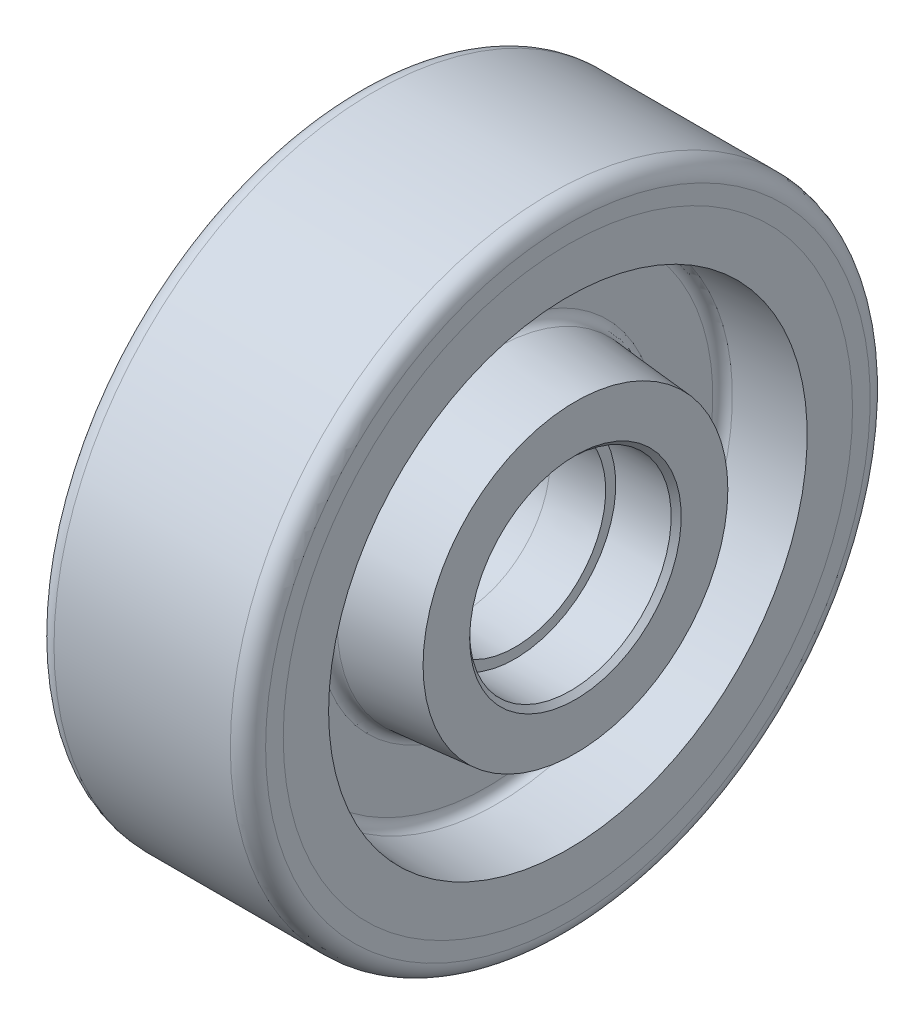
ISO-10303-21;
HEADER;
FILE_DESCRIPTION(('STEP AP214'),'2;1');
FILE_NAME('part.step','',(''),(''),'','','');
FILE_SCHEMA(('AUTOMOTIVE_DESIGN { 1 0 10303 214 1 1 1 1 }'));
ENDSEC;
DATA;
#1=APPLICATION_CONTEXT('core data for automotive mechanical design processes');
#2=APPLICATION_PROTOCOL_DEFINITION('international standard','automotive_design',2000,#1);
#3=PRODUCT_CONTEXT('',#1,'mechanical');
#4=PRODUCT('Part','Part','',(#3));
#5=PRODUCT_RELATED_PRODUCT_CATEGORY('part','',(#4));
#6=PRODUCT_DEFINITION_FORMATION('','',#4);
#7=PRODUCT_DEFINITION_CONTEXT('part definition',#1,'design');
#8=PRODUCT_DEFINITION('design','',#6,#7);
#9=PRODUCT_DEFINITION_SHAPE('','',#8);
#10=(LENGTH_UNIT() NAMED_UNIT(*) SI_UNIT(.MILLI.,.METRE.));
#11=(NAMED_UNIT(*) PLANE_ANGLE_UNIT() SI_UNIT($,.RADIAN.));
#12=(NAMED_UNIT(*) SI_UNIT($,.STERADIAN.) SOLID_ANGLE_UNIT());
#13=UNCERTAINTY_MEASURE_WITH_UNIT(LENGTH_MEASURE(1.E-05),#10,'distance_accuracy_value','');
#14=(GEOMETRIC_REPRESENTATION_CONTEXT(3) GLOBAL_UNCERTAINTY_ASSIGNED_CONTEXT((#13)) GLOBAL_UNIT_ASSIGNED_CONTEXT((#10,
#11,#12)) REPRESENTATION_CONTEXT('',''));
#15=CARTESIAN_POINT('',(0.,0.,0.));
#16=DIRECTION('',(0.,0.,1.));
#17=DIRECTION('',(1.,0.,0.));
#18=AXIS2_PLACEMENT_3D('',#15,#16,#17);
#19=CARTESIAN_POINT('',(-17.5000000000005,0.,0.));
#20=DIRECTION('',(-1.,0.,0.));
#21=DIRECTION('',(0.,0.,1.));
#22=AXIS2_PLACEMENT_3D('',#19,#20,#21);
#23=TOROIDAL_SURFACE('',#22,60.,3.5);
#24=CARTESIAN_POINT('',(-21.0000000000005,0.,0.));
#25=DIRECTION('',(-1.,0.,0.));
#26=DIRECTION('',(0.,0.,1.));
#27=AXIS2_PLACEMENT_3D('',#24,#25,#26);
#28=CIRCLE('',#27,59.9999999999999);
#29=CARTESIAN_POINT('',(-21.0000000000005,0.,59.9999999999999));
#30=VERTEX_POINT('',#29);
#31=EDGE_CURVE('E11',#30,#30,#28,.T.);
#32=ORIENTED_EDGE('',*,*,#31,.F.);
#33=EDGE_LOOP('',(#32));
#34=FACE_BOUND('',#33,.T.);
#35=CARTESIAN_POINT('',(-17.5000000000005,0.,0.));
#36=DIRECTION('',(-1.,0.,0.));
#37=DIRECTION('',(0.,0.,1.));
#38=AXIS2_PLACEMENT_3D('',#35,#36,#37);
#39=CIRCLE('',#38,63.5);
#40=CARTESIAN_POINT('',(-17.5000000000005,0.,63.5));
#41=VERTEX_POINT('',#40);
#42=EDGE_CURVE('E70',#41,#41,#39,.T.);
#43=ORIENTED_EDGE('',*,*,#42,.T.);
#44=EDGE_LOOP('',(#43));
#45=FACE_BOUND('',#44,.T.);
#46=ADVANCED_FACE('F45',(#34,#45),#23,.T.);
#47=CARTESIAN_POINT('',(-21.0000000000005,0.,-56.5));
#48=DIRECTION('',(1.,0.,0.));
#49=DIRECTION('',(0.,0.,-1.));
#50=AXIS2_PLACEMENT_3D('',#47,#48,#49);
#51=PLANE('',#50);
#52=CARTESIAN_POINT('',(-21.0000000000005,0.,0.));
#53=DIRECTION('',(-1.,0.,0.));
#54=DIRECTION('',(0.,0.,1.));
#55=AXIS2_PLACEMENT_3D('',#52,#53,#54);
#56=CIRCLE('',#55,56.5);
#57=CARTESIAN_POINT('',(-21.0000000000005,0.,56.5));
#58=VERTEX_POINT('',#57);
#59=EDGE_CURVE('E51',#58,#58,#56,.T.);
#60=ORIENTED_EDGE('',*,*,#59,.F.);
#61=EDGE_LOOP('',(#60));
#62=FACE_BOUND('',#61,.T.);
#63=ORIENTED_EDGE('',*,*,#31,.T.);
#64=EDGE_LOOP('',(#63));
#65=FACE_BOUND('',#64,.T.);
#66=ADVANCED_FACE('F101',(#62,#65),#51,.F.);
#67=CARTESIAN_POINT('',(-21.0000000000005,0.,0.));
#68=DIRECTION('',(1.,0.,0.));
#69=DIRECTION('',(0.,0.,-1.));
#70=AXIS2_PLACEMENT_3D('',#67,#68,#69);
#71=CONICAL_SURFACE('',#70,56.5,0.0523598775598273);
#72=CARTESIAN_POINT('',(-4.54497550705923E-13,0.,0.));
#73=DIRECTION('',(-1.,0.,0.));
#74=DIRECTION('',(0.,0.,1.));
#75=AXIS2_PLACEMENT_3D('',#72,#73,#74);
#76=CIRCLE('',#75,57.6005633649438);
#77=CARTESIAN_POINT('',(-4.54497550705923E-13,0.,57.6005633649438));
#78=VERTEX_POINT('',#77);
#79=EDGE_CURVE('E55',#78,#78,#76,.T.);
#80=ORIENTED_EDGE('',*,*,#79,.F.);
#81=EDGE_LOOP('',(#80));
#82=FACE_BOUND('',#81,.T.);
#83=ORIENTED_EDGE('',*,*,#59,.T.);
#84=EDGE_LOOP('',(#83));
#85=FACE_BOUND('',#84,.T.);
#86=ADVANCED_FACE('F96',(#82,#85),#71,.F.);
#87=CARTESIAN_POINT('',(-4.54497550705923E-13,0.,0.));
#88=DIRECTION('',(-1.,0.,0.));
#89=DIRECTION('',(0.,0.,1.));
#90=AXIS2_PLACEMENT_3D('',#87,#88,#89);
#91=CONICAL_SURFACE('',#90,57.6005633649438,0.0523598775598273);
#92=CARTESIAN_POINT('',(20.9999999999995,0.,0.));
#93=DIRECTION('',(-1.,0.,0.));
#94=DIRECTION('',(0.,0.,1.));
#95=AXIS2_PLACEMENT_3D('',#92,#93,#94);
#96=CIRCLE('',#95,56.5);
#97=CARTESIAN_POINT('',(20.9999999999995,0.,56.5));
#98=VERTEX_POINT('',#97);
#99=EDGE_CURVE('E59',#98,#98,#96,.T.);
#100=ORIENTED_EDGE('',*,*,#99,.F.);
#101=EDGE_LOOP('',(#100));
#102=FACE_BOUND('',#101,.T.);
#103=ORIENTED_EDGE('',*,*,#79,.T.);
#104=EDGE_LOOP('',(#103));
#105=FACE_BOUND('',#104,.T.);
#106=ADVANCED_FACE('F90',(#102,#105),#91,.F.);
#107=CARTESIAN_POINT('',(20.9999999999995,0.,-56.5));
#108=DIRECTION('',(-1.,0.,0.));
#109=DIRECTION('',(0.,0.,1.));
#110=AXIS2_PLACEMENT_3D('',#107,#108,#109);
#111=PLANE('',#110);
#112=CARTESIAN_POINT('',(20.9999999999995,0.,0.));
#113=DIRECTION('',(-1.,0.,0.));
#114=DIRECTION('',(0.,0.,1.));
#115=AXIS2_PLACEMENT_3D('',#112,#113,#114);
#116=CIRCLE('',#115,60.);
#117=CARTESIAN_POINT('',(20.9999999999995,0.,60.));
#118=VERTEX_POINT('',#117);
#119=EDGE_CURVE('E64',#118,#118,#116,.T.);
#120=ORIENTED_EDGE('',*,*,#119,.F.);
#121=EDGE_LOOP('',(#120));
#122=FACE_BOUND('',#121,.T.);
#123=ORIENTED_EDGE('',*,*,#99,.T.);
#124=EDGE_LOOP('',(#123));
#125=FACE_BOUND('',#124,.T.);
#126=ADVANCED_FACE('F84',(#122,#125),#111,.F.);
#127=CARTESIAN_POINT('',(17.4999999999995,0.,0.));
#128=DIRECTION('',(-1.,0.,0.));
#129=DIRECTION('',(0.,0.,1.));
#130=AXIS2_PLACEMENT_3D('',#127,#128,#129);
#131=TOROIDAL_SURFACE('',#130,60.,3.5);
#132=CARTESIAN_POINT('',(17.4999999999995,0.,0.));
#133=DIRECTION('',(-1.,0.,0.));
#134=DIRECTION('',(0.,0.,1.));
#135=AXIS2_PLACEMENT_3D('',#132,#133,#134);
#136=CIRCLE('',#135,63.5);
#137=CARTESIAN_POINT('',(17.4999999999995,0.,63.5));
#138=VERTEX_POINT('',#137);
#139=EDGE_CURVE('E67',#138,#138,#136,.T.);
#140=ORIENTED_EDGE('',*,*,#139,.F.);
#141=EDGE_LOOP('',(#140));
#142=FACE_BOUND('',#141,.T.);
#143=ORIENTED_EDGE('',*,*,#119,.T.);
#144=EDGE_LOOP('',(#143));
#145=FACE_BOUND('',#144,.T.);
#146=ADVANCED_FACE('F78',(#142,#145),#131,.T.);
#147=CARTESIAN_POINT('',(-24.8072464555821,0.,0.));
#148=DIRECTION('',(-1.,0.,0.));
#149=DIRECTION('',(0.,0.,1.));
#150=AXIS2_PLACEMENT_3D('',#147,#148,#149);
#151=CYLINDRICAL_SURFACE('',#150,63.5);
#152=ORIENTED_EDGE('',*,*,#42,.F.);
#153=EDGE_LOOP('',(#152));
#154=FACE_BOUND('',#153,.T.);
#155=ORIENTED_EDGE('',*,*,#139,.T.);
#156=EDGE_LOOP('',(#155));
#157=FACE_BOUND('',#156,.T.);
#158=ADVANCED_FACE('F75',(#154,#157),#151,.T.);
#159=CLOSED_SHELL('',(#46,#66,#86,#106,#126,#146,#158));
#160=MANIFOLD_SOLID_BREP('B2',#159);
#161=CARTESIAN_POINT('',(22.4999999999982,0.,-21.));
#162=DIRECTION('',(-1.,0.,0.));
#163=DIRECTION('',(0.,0.,1.));
#164=AXIS2_PLACEMENT_3D('',#161,#162,#163);
#165=PLANE('',#164);
#166=CARTESIAN_POINT('',(22.4999999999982,0.,0.));
#167=DIRECTION('',(-1.,0.,0.));
#168=DIRECTION('',(0.,0.,1.));
#169=AXIS2_PLACEMENT_3D('',#166,#167,#168);
#170=CIRCLE('',#169,30.25);
#171=CARTESIAN_POINT('',(22.4999999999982,0.,30.25));
#172=VERTEX_POINT('',#171);
#173=EDGE_CURVE('E44',#172,#172,#170,.T.);
#174=ORIENTED_EDGE('',*,*,#173,.F.);
#175=EDGE_LOOP('',(#174));
#176=FACE_BOUND('',#175,.T.);
#177=CARTESIAN_POINT('',(22.4999999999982,0.,0.));
#178=DIRECTION('',(-1.,0.,0.));
#179=DIRECTION('',(0.,0.,1.));
#180=AXIS2_PLACEMENT_3D('',#177,#178,#179);
#181=CIRCLE('',#180,21.);
#182=CARTESIAN_POINT('',(22.4999999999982,0.,21.));
#183=VERTEX_POINT('',#182);
#184=EDGE_CURVE('E228',#183,#183,#181,.T.);
#185=ORIENTED_EDGE('',*,*,#184,.T.);
#186=EDGE_LOOP('',(#185));
#187=FACE_BOUND('',#186,.T.);
#188=ADVANCED_FACE('F152',(#176,#187),#165,.F.);
#189=CARTESIAN_POINT('',(22.4999999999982,0.,0.));
#190=DIRECTION('',(-1.,0.,0.));
#191=DIRECTION('',(0.,0.,1.));
#192=AXIS2_PLACEMENT_3D('',#189,#190,#191);
#193=CONICAL_SURFACE('',#192,30.25,0.0872664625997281);
#194=CARTESIAN_POINT('',(6.82568851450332,0.,0.));
#195=DIRECTION('',(-1.,0.,0.));
#196=DIRECTION('',(0.,0.,1.));
#197=AXIS2_PLACEMENT_3D('',#194,#195,#196);
#198=CIRCLE('',#197,31.6213245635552);
#199=CARTESIAN_POINT('',(6.82568851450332,0.,31.6213245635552));
#200=VERTEX_POINT('',#199);
#201=EDGE_CURVE('E158',#200,#200,#198,.T.);
#202=ORIENTED_EDGE('',*,*,#201,.F.);
#203=EDGE_LOOP('',(#202));
#204=FACE_BOUND('',#203,.T.);
#205=ORIENTED_EDGE('',*,*,#173,.T.);
#206=EDGE_LOOP('',(#205));
#207=FACE_BOUND('',#206,.T.);
#208=ADVANCED_FACE('F361',(#204,#207),#193,.T.);
#209=CARTESIAN_POINT('',(6.99999999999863,0.,0.));
#210=DIRECTION('',(-1.,0.,0.));
#211=DIRECTION('',(0.,0.,1.));
#212=AXIS2_PLACEMENT_3D('',#209,#210,#211);
#213=TOROIDAL_SURFACE('',#212,33.6137139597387,2.);
#214=CARTESIAN_POINT('',(4.99999999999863,0.,0.));
#215=DIRECTION('',(-1.,0.,0.));
#216=DIRECTION('',(0.,0.,1.));
#217=AXIS2_PLACEMENT_3D('',#214,#215,#216);
#218=CIRCLE('',#217,33.6137139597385);
#219=CARTESIAN_POINT('',(4.99999999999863,0.,33.6137139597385));
#220=VERTEX_POINT('',#219);
#221=EDGE_CURVE('E162',#220,#220,#218,.T.);
#222=ORIENTED_EDGE('',*,*,#221,.F.);
#223=EDGE_LOOP('',(#222));
#224=FACE_BOUND('',#223,.T.);
#225=ORIENTED_EDGE('',*,*,#201,.T.);
#226=EDGE_LOOP('',(#225));
#227=FACE_BOUND('',#226,.T.);
#228=ADVANCED_FACE('F356',(#224,#227),#213,.F.);
#229=CARTESIAN_POINT('',(4.99999999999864,0.,-33.6137139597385));
#230=DIRECTION('',(-1.,0.,0.));
#231=DIRECTION('',(0.,0.,1.));
#232=AXIS2_PLACEMENT_3D('',#229,#230,#231);
#233=PLANE('',#232);
#234=CARTESIAN_POINT('',(4.99999999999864,0.,0.));
#235=DIRECTION('',(-1.,0.,0.));
#236=DIRECTION('',(0.,0.,1.));
#237=AXIS2_PLACEMENT_3D('',#234,#235,#236);
#238=CIRCLE('',#237,44.7635463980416);
#239=CARTESIAN_POINT('',(4.99999999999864,0.,44.7635463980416));
#240=VERTEX_POINT('',#239);
#241=EDGE_CURVE('E166',#240,#240,#238,.T.);
#242=ORIENTED_EDGE('',*,*,#241,.F.);
#243=EDGE_LOOP('',(#242));
#244=FACE_BOUND('',#243,.T.);
#245=ORIENTED_EDGE('',*,*,#221,.T.);
#246=EDGE_LOOP('',(#245));
#247=FACE_BOUND('',#246,.T.);
#248=ADVANCED_FACE('F350',(#244,#247),#233,.F.);
#249=CARTESIAN_POINT('',(6.99999999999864,0.,0.));
#250=DIRECTION('',(-1.,0.,0.));
#251=DIRECTION('',(0.,0.,1.));
#252=AXIS2_PLACEMENT_3D('',#249,#250,#251);
#253=TOROIDAL_SURFACE('',#252,44.7635463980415,2.);
#254=CARTESIAN_POINT('',(6.89532808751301,0.,0.));
#255=DIRECTION('',(-1.,0.,0.));
#256=DIRECTION('',(0.,0.,1.));
#257=AXIS2_PLACEMENT_3D('',#254,#255,#256);
#258=CIRCLE('',#257,46.7608054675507);
#259=CARTESIAN_POINT('',(6.89532808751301,0.,46.7608054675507));
#260=VERTEX_POINT('',#259);
#261=EDGE_CURVE('E171',#260,#260,#258,.T.);
#262=ORIENTED_EDGE('',*,*,#261,.F.);
#263=EDGE_LOOP('',(#262));
#264=FACE_BOUND('',#263,.T.);
#265=ORIENTED_EDGE('',*,*,#241,.T.);
#266=EDGE_LOOP('',(#265));
#267=FACE_BOUND('',#266,.T.);
#268=ADVANCED_FACE('F344',(#264,#267),#253,.F.);
#269=CARTESIAN_POINT('',(6.89532808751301,0.,0.));
#270=DIRECTION('',(1.,0.,0.));
#271=DIRECTION('',(0.,0.,-1.));
#272=AXIS2_PLACEMENT_3D('',#269,#270,#271);
#273=CONICAL_SURFACE('',#272,46.7608054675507,0.0523598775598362);
#274=CARTESIAN_POINT('',(20.9999999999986,0.,0.));
#275=DIRECTION('',(-1.,0.,0.));
#276=DIRECTION('',(0.,0.,1.));
#277=AXIS2_PLACEMENT_3D('',#274,#275,#276);
#278=CIRCLE('',#277,47.5);
#279=CARTESIAN_POINT('',(20.9999999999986,0.,47.5));
#280=VERTEX_POINT('',#279);
#281=EDGE_CURVE('E174',#280,#280,#278,.T.);
#282=ORIENTED_EDGE('',*,*,#281,.F.);
#283=EDGE_LOOP('',(#282));
#284=FACE_BOUND('',#283,.T.);
#285=ORIENTED_EDGE('',*,*,#261,.T.);
#286=EDGE_LOOP('',(#285));
#287=FACE_BOUND('',#286,.T.);
#288=ADVANCED_FACE('F338',(#284,#287),#273,.F.);
#289=CARTESIAN_POINT('',(20.9999999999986,0.,-47.5));
#290=DIRECTION('',(-1.,0.,0.));
#291=DIRECTION('',(0.,0.,1.));
#292=AXIS2_PLACEMENT_3D('',#289,#290,#291);
#293=PLANE('',#292);
#294=CARTESIAN_POINT('',(20.9999999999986,0.,0.));
#295=DIRECTION('',(-1.,0.,0.));
#296=DIRECTION('',(0.,0.,1.));
#297=AXIS2_PLACEMENT_3D('',#294,#295,#296);
#298=CIRCLE('',#297,56.4999999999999);
#299=CARTESIAN_POINT('',(20.9999999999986,0.,56.4999999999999));
#300=VERTEX_POINT('',#299);
#301=EDGE_CURVE('E177',#300,#300,#298,.T.);
#302=ORIENTED_EDGE('',*,*,#301,.F.);
#303=EDGE_LOOP('',(#302));
#304=FACE_BOUND('',#303,.T.);
#305=ORIENTED_EDGE('',*,*,#281,.T.);
#306=EDGE_LOOP('',(#305));
#307=FACE_BOUND('',#306,.T.);
#308=ADVANCED_FACE('F332',(#304,#307),#293,.F.);
#309=CARTESIAN_POINT('',(20.9999999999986,0.,0.));
#310=DIRECTION('',(-1.,0.,0.));
#311=DIRECTION('',(0.,0.,1.));
#312=AXIS2_PLACEMENT_3D('',#309,#310,#311);
#313=CONICAL_SURFACE('',#312,56.4999999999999,0.0523598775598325);
#314=CARTESIAN_POINT('',(-1.36002320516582E-12,0.,0.));
#315=DIRECTION('',(-1.,0.,0.));
#316=DIRECTION('',(0.,0.,1.));
#317=AXIS2_PLACEMENT_3D('',#314,#315,#316);
#318=CIRCLE('',#317,57.6005633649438);
#319=CARTESIAN_POINT('',(-1.36002320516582E-12,0.,57.6005633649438));
#320=VERTEX_POINT('',#319);
#321=EDGE_CURVE('E180',#320,#320,#318,.T.);
#322=ORIENTED_EDGE('',*,*,#321,.F.);
#323=EDGE_LOOP('',(#322));
#324=FACE_BOUND('',#323,.T.);
#325=ORIENTED_EDGE('',*,*,#301,.T.);
#326=EDGE_LOOP('',(#325));
#327=FACE_BOUND('',#326,.T.);
#328=ADVANCED_FACE('F326',(#324,#327),#313,.T.);
#329=CARTESIAN_POINT('',(-1.36002320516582E-12,0.,0.));
#330=DIRECTION('',(1.,0.,0.));
#331=DIRECTION('',(0.,0.,-1.));
#332=AXIS2_PLACEMENT_3D('',#329,#330,#331);
#333=CONICAL_SURFACE('',#332,57.6005633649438,0.0523598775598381);
#334=CARTESIAN_POINT('',(-21.0000000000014,0.,0.));
#335=DIRECTION('',(-1.,0.,0.));
#336=DIRECTION('',(0.,0.,1.));
#337=AXIS2_PLACEMENT_3D('',#334,#335,#336);
#338=CIRCLE('',#337,56.4999999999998);
#339=CARTESIAN_POINT('',(-21.0000000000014,0.,56.4999999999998));
#340=VERTEX_POINT('',#339);
#341=EDGE_CURVE('E183',#340,#340,#338,.T.);
#342=ORIENTED_EDGE('',*,*,#341,.F.);
#343=EDGE_LOOP('',(#342));
#344=FACE_BOUND('',#343,.T.);
#345=ORIENTED_EDGE('',*,*,#321,.T.);
#346=EDGE_LOOP('',(#345));
#347=FACE_BOUND('',#346,.T.);
#348=ADVANCED_FACE('F320',(#344,#347),#333,.T.);
#349=CARTESIAN_POINT('',(-21.0000000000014,0.,-47.5));
#350=DIRECTION('',(1.,0.,0.));
#351=DIRECTION('',(0.,0.,-1.));
#352=AXIS2_PLACEMENT_3D('',#349,#350,#351);
#353=PLANE('',#352);
#354=CARTESIAN_POINT('',(-21.0000000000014,0.,0.));
#355=DIRECTION('',(-1.,0.,0.));
#356=DIRECTION('',(0.,0.,1.));
#357=AXIS2_PLACEMENT_3D('',#354,#355,#356);
#358=CIRCLE('',#357,47.5);
#359=CARTESIAN_POINT('',(-21.0000000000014,0.,47.5));
#360=VERTEX_POINT('',#359);
#361=EDGE_CURVE('E186',#360,#360,#358,.T.);
#362=ORIENTED_EDGE('',*,*,#361,.F.);
#363=EDGE_LOOP('',(#362));
#364=FACE_BOUND('',#363,.T.);
#365=ORIENTED_EDGE('',*,*,#341,.T.);
#366=EDGE_LOOP('',(#365));
#367=FACE_BOUND('',#366,.T.);
#368=ADVANCED_FACE('F314',(#364,#367),#353,.F.);
#369=CARTESIAN_POINT('',(-21.0000000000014,0.,0.));
#370=DIRECTION('',(-1.,0.,0.));
#371=DIRECTION('',(0.,0.,1.));
#372=AXIS2_PLACEMENT_3D('',#369,#370,#371);
#373=CONICAL_SURFACE('',#372,47.5,0.0523598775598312);
#374=CARTESIAN_POINT('',(-6.89532808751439,0.,0.));
#375=DIRECTION('',(-1.,0.,0.));
#376=DIRECTION('',(0.,0.,1.));
#377=AXIS2_PLACEMENT_3D('',#374,#375,#376);
#378=CIRCLE('',#377,46.7608054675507);
#379=CARTESIAN_POINT('',(-6.89532808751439,0.,46.7608054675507));
#380=VERTEX_POINT('',#379);
#381=EDGE_CURVE('E189',#380,#380,#378,.T.);
#382=ORIENTED_EDGE('',*,*,#381,.F.);
#383=EDGE_LOOP('',(#382));
#384=FACE_BOUND('',#383,.T.);
#385=ORIENTED_EDGE('',*,*,#361,.T.);
#386=EDGE_LOOP('',(#385));
#387=FACE_BOUND('',#386,.T.);
#388=ADVANCED_FACE('F308',(#384,#387),#373,.F.);
#389=CARTESIAN_POINT('',(-7.00000000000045,0.,0.));
#390=DIRECTION('',(-1.,0.,0.));
#391=DIRECTION('',(0.,0.,1.));
#392=AXIS2_PLACEMENT_3D('',#389,#390,#391);
#393=TOROIDAL_SURFACE('',#392,44.7635463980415,2.);
#394=CARTESIAN_POINT('',(-5.00000000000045,0.,0.));
#395=DIRECTION('',(-1.,0.,0.));
#396=DIRECTION('',(0.,0.,1.));
#397=AXIS2_PLACEMENT_3D('',#394,#395,#396);
#398=CIRCLE('',#397,44.7635463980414);
#399=CARTESIAN_POINT('',(-5.00000000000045,0.,44.7635463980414));
#400=VERTEX_POINT('',#399);
#401=EDGE_CURVE('E192',#400,#400,#398,.T.);
#402=ORIENTED_EDGE('',*,*,#401,.F.);
#403=EDGE_LOOP('',(#402));
#404=FACE_BOUND('',#403,.T.);
#405=ORIENTED_EDGE('',*,*,#381,.T.);
#406=EDGE_LOOP('',(#405));
#407=FACE_BOUND('',#406,.T.);
#408=ADVANCED_FACE('F302',(#404,#407),#393,.F.);
#409=CARTESIAN_POINT('',(-5.00000000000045,0.,-33.6137139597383));
#410=DIRECTION('',(1.,0.,0.));
#411=DIRECTION('',(0.,0.,-1.));
#412=AXIS2_PLACEMENT_3D('',#409,#410,#411);
#413=PLANE('',#412);
#414=CARTESIAN_POINT('',(-5.00000000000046,0.,0.));
#415=DIRECTION('',(-1.,0.,0.));
#416=DIRECTION('',(0.,0.,1.));
#417=AXIS2_PLACEMENT_3D('',#414,#415,#416);
#418=CIRCLE('',#417,33.6137139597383);
#419=CARTESIAN_POINT('',(-5.00000000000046,0.,33.6137139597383));
#420=VERTEX_POINT('',#419);
#421=EDGE_CURVE('E195',#420,#420,#418,.T.);
#422=ORIENTED_EDGE('',*,*,#421,.F.);
#423=EDGE_LOOP('',(#422));
#424=FACE_BOUND('',#423,.T.);
#425=ORIENTED_EDGE('',*,*,#401,.T.);
#426=EDGE_LOOP('',(#425));
#427=FACE_BOUND('',#426,.T.);
#428=ADVANCED_FACE('F296',(#424,#427),#413,.F.);
#429=CARTESIAN_POINT('',(-7.00000000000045,0.,0.));
#430=DIRECTION('',(-1.,0.,0.));
#431=DIRECTION('',(0.,0.,1.));
#432=AXIS2_PLACEMENT_3D('',#429,#430,#431);
#433=TOROIDAL_SURFACE('',#432,33.6137139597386,2.);
#434=CARTESIAN_POINT('',(-6.82568851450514,0.,0.));
#435=DIRECTION('',(-1.,0.,0.));
#436=DIRECTION('',(0.,0.,1.));
#437=AXIS2_PLACEMENT_3D('',#434,#435,#436);
#438=CIRCLE('',#437,31.6213245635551);
#439=CARTESIAN_POINT('',(-6.82568851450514,0.,31.6213245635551));
#440=VERTEX_POINT('',#439);
#441=EDGE_CURVE('E198',#440,#440,#438,.T.);
#442=ORIENTED_EDGE('',*,*,#441,.F.);
#443=EDGE_LOOP('',(#442));
#444=FACE_BOUND('',#443,.T.);
#445=ORIENTED_EDGE('',*,*,#421,.T.);
#446=EDGE_LOOP('',(#445));
#447=FACE_BOUND('',#446,.T.);
#448=ADVANCED_FACE('F290',(#444,#447),#433,.F.);
#449=CARTESIAN_POINT('',(-6.82568851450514,0.,0.));
#450=DIRECTION('',(1.,0.,0.));
#451=DIRECTION('',(0.,0.,-1.));
#452=AXIS2_PLACEMENT_3D('',#449,#450,#451);
#453=CONICAL_SURFACE('',#452,31.6213245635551,0.0872664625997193);
#454=CARTESIAN_POINT('',(-22.5000000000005,0.,0.));
#455=DIRECTION('',(-1.,0.,0.));
#456=DIRECTION('',(0.,0.,1.));
#457=AXIS2_PLACEMENT_3D('',#454,#455,#456);
#458=CIRCLE('',#457,30.25);
#459=CARTESIAN_POINT('',(-22.5000000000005,0.,30.25));
#460=VERTEX_POINT('',#459);
#461=EDGE_CURVE('E201',#460,#460,#458,.T.);
#462=ORIENTED_EDGE('',*,*,#461,.F.);
#463=EDGE_LOOP('',(#462));
#464=FACE_BOUND('',#463,.T.);
#465=ORIENTED_EDGE('',*,*,#441,.T.);
#466=EDGE_LOOP('',(#465));
#467=FACE_BOUND('',#466,.T.);
#468=ADVANCED_FACE('F284',(#464,#467),#453,.T.);
#469=CARTESIAN_POINT('',(-22.5000000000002,0.,-30.25));
#470=DIRECTION('',(1.,0.,0.));
#471=DIRECTION('',(0.,0.,-1.));
#472=AXIS2_PLACEMENT_3D('',#469,#470,#471);
#473=PLANE('',#472);
#474=CARTESIAN_POINT('',(-22.5,0.,0.));
#475=DIRECTION('',(-1.,0.,0.));
#476=DIRECTION('',(0.,0.,1.));
#477=AXIS2_PLACEMENT_3D('',#474,#475,#476);
#478=CIRCLE('',#477,21.0000000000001);
#479=CARTESIAN_POINT('',(-22.5,0.,21.0000000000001));
#480=VERTEX_POINT('',#479);
#481=EDGE_CURVE('E204',#480,#480,#478,.T.);
#482=ORIENTED_EDGE('',*,*,#481,.F.);
#483=EDGE_LOOP('',(#482));
#484=FACE_BOUND('',#483,.T.);
#485=ORIENTED_EDGE('',*,*,#461,.T.);
#486=EDGE_LOOP('',(#485));
#487=FACE_BOUND('',#486,.T.);
#488=ADVANCED_FACE('F278',(#484,#487),#473,.F.);
#489=CARTESIAN_POINT('',(-22.5,0.,0.));
#490=DIRECTION('',(-1.,0.,0.));
#491=DIRECTION('',(0.,0.,1.));
#492=AXIS2_PLACEMENT_3D('',#489,#490,#491);
#493=CONICAL_SURFACE('',#492,21.0000000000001,0.78539816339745);
#494=CARTESIAN_POINT('',(-21.5,0.,0.));
#495=DIRECTION('',(-1.,0.,0.));
#496=DIRECTION('',(0.,0.,1.));
#497=AXIS2_PLACEMENT_3D('',#494,#495,#496);
#498=CIRCLE('',#497,20.0000000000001);
#499=CARTESIAN_POINT('',(-21.5,0.,20.0000000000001));
#500=VERTEX_POINT('',#499);
#501=EDGE_CURVE('E207',#500,#500,#498,.T.);
#502=ORIENTED_EDGE('',*,*,#501,.F.);
#503=EDGE_LOOP('',(#502));
#504=FACE_BOUND('',#503,.T.);
#505=ORIENTED_EDGE('',*,*,#481,.T.);
#506=EDGE_LOOP('',(#505));
#507=FACE_BOUND('',#506,.T.);
#508=ADVANCED_FACE('F272',(#504,#507),#493,.F.);
#509=CARTESIAN_POINT('',(-24.8072464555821,0.,0.));
#510=DIRECTION('',(-1.,0.,0.));
#511=DIRECTION('',(0.,0.,1.));
#512=AXIS2_PLACEMENT_3D('',#509,#510,#511);
#513=CYLINDRICAL_SURFACE('',#512,20.0000000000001);
#514=CARTESIAN_POINT('',(-10.5000000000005,0.,0.));
#515=DIRECTION('',(-1.,0.,0.));
#516=DIRECTION('',(0.,0.,1.));
#517=AXIS2_PLACEMENT_3D('',#514,#515,#516);
#518=CIRCLE('',#517,20.);
#519=CARTESIAN_POINT('',(-10.5000000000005,0.,20.));
#520=VERTEX_POINT('',#519);
#521=EDGE_CURVE('E210',#520,#520,#518,.T.);
#522=ORIENTED_EDGE('',*,*,#521,.F.);
#523=EDGE_LOOP('',(#522));
#524=FACE_BOUND('',#523,.T.);
#525=ORIENTED_EDGE('',*,*,#501,.T.);
#526=EDGE_LOOP('',(#525));
#527=FACE_BOUND('',#526,.T.);
#528=ADVANCED_FACE('F266',(#524,#527),#513,.F.);
#529=CARTESIAN_POINT('',(-10.5000000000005,0.,-20.));
#530=DIRECTION('',(1.,0.,0.));
#531=DIRECTION('',(0.,0.,-1.));
#532=AXIS2_PLACEMENT_3D('',#529,#530,#531);
#533=PLANE('',#532);
#534=CARTESIAN_POINT('',(-10.5000000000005,0.,0.));
#535=DIRECTION('',(-1.,0.,0.));
#536=DIRECTION('',(0.,0.,1.));
#537=AXIS2_PLACEMENT_3D('',#534,#535,#536);
#538=CIRCLE('',#537,17.9999999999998);
#539=CARTESIAN_POINT('',(-10.5000000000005,0.,17.9999999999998));
#540=VERTEX_POINT('',#539);
#541=EDGE_CURVE('E213',#540,#540,#538,.T.);
#542=ORIENTED_EDGE('',*,*,#541,.F.);
#543=EDGE_LOOP('',(#542));
#544=FACE_BOUND('',#543,.T.);
#545=ORIENTED_EDGE('',*,*,#521,.T.);
#546=EDGE_LOOP('',(#545));
#547=FACE_BOUND('',#546,.T.);
#548=ADVANCED_FACE('F260',(#544,#547),#533,.F.);
#549=CARTESIAN_POINT('',(-10.5000000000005,0.,0.));
#550=DIRECTION('',(-1.,0.,0.));
#551=DIRECTION('',(0.,0.,1.));
#552=AXIS2_PLACEMENT_3D('',#549,#550,#551);
#553=CONICAL_SURFACE('',#552,17.9999999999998,0.0523598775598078);
#554=CARTESIAN_POINT('',(-9.08995101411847E-13,0.,0.));
#555=DIRECTION('',(-1.,0.,0.));
#556=DIRECTION('',(0.,0.,1.));
#557=AXIS2_PLACEMENT_3D('',#554,#555,#556);
#558=CIRCLE('',#557,17.4497183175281);
#559=CARTESIAN_POINT('',(-9.08995101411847E-13,0.,17.4497183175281));
#560=VERTEX_POINT('',#559);
#561=EDGE_CURVE('E216',#560,#560,#558,.T.);
#562=ORIENTED_EDGE('',*,*,#561,.F.);
#563=EDGE_LOOP('',(#562));
#564=FACE_BOUND('',#563,.T.);
#565=ORIENTED_EDGE('',*,*,#541,.T.);
#566=EDGE_LOOP('',(#565));
#567=FACE_BOUND('',#566,.T.);
#568=ADVANCED_FACE('F254',(#564,#567),#553,.F.);
#569=CARTESIAN_POINT('',(-9.08995101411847E-13,0.,0.));
#570=DIRECTION('',(1.,0.,0.));
#571=DIRECTION('',(0.,0.,-1.));
#572=AXIS2_PLACEMENT_3D('',#569,#570,#571);
#573=CONICAL_SURFACE('',#572,17.4497183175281,0.0523598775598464);
#574=CARTESIAN_POINT('',(10.4999999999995,0.,0.));
#575=DIRECTION('',(-1.,0.,0.));
#576=DIRECTION('',(0.,0.,1.));
#577=AXIS2_PLACEMENT_3D('',#574,#575,#576);
#578=CIRCLE('',#577,18.0000000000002);
#579=CARTESIAN_POINT('',(10.4999999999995,0.,18.0000000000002));
#580=VERTEX_POINT('',#579);
#581=EDGE_CURVE('E219',#580,#580,#578,.T.);
#582=ORIENTED_EDGE('',*,*,#581,.F.);
#583=EDGE_LOOP('',(#582));
#584=FACE_BOUND('',#583,.T.);
#585=ORIENTED_EDGE('',*,*,#561,.T.);
#586=EDGE_LOOP('',(#585));
#587=FACE_BOUND('',#586,.T.);
#588=ADVANCED_FACE('F248',(#584,#587),#573,.F.);
#589=CARTESIAN_POINT('',(10.4999999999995,0.,-18.0000000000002));
#590=DIRECTION('',(-1.,0.,0.));
#591=DIRECTION('',(0.,0.,1.));
#592=AXIS2_PLACEMENT_3D('',#589,#590,#591);
#593=PLANE('',#592);
#594=CARTESIAN_POINT('',(10.4999999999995,0.,0.));
#595=DIRECTION('',(-1.,0.,0.));
#596=DIRECTION('',(0.,0.,1.));
#597=AXIS2_PLACEMENT_3D('',#594,#595,#596);
#598=CIRCLE('',#597,19.9999999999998);
#599=CARTESIAN_POINT('',(10.4999999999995,0.,19.9999999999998));
#600=VERTEX_POINT('',#599);
#601=EDGE_CURVE('E222',#600,#600,#598,.T.);
#602=ORIENTED_EDGE('',*,*,#601,.F.);
#603=EDGE_LOOP('',(#602));
#604=FACE_BOUND('',#603,.T.);
#605=ORIENTED_EDGE('',*,*,#581,.T.);
#606=EDGE_LOOP('',(#605));
#607=FACE_BOUND('',#606,.T.);
#608=ADVANCED_FACE('F242',(#604,#607),#593,.F.);
#609=CARTESIAN_POINT('',(-24.8072464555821,0.,0.));
#610=DIRECTION('',(-1.,0.,0.));
#611=DIRECTION('',(0.,0.,1.));
#612=AXIS2_PLACEMENT_3D('',#609,#610,#611);
#613=CYLINDRICAL_SURFACE('',#612,19.9999999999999);
#614=CARTESIAN_POINT('',(21.4999999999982,0.,0.));
#615=DIRECTION('',(-1.,0.,0.));
#616=DIRECTION('',(0.,0.,1.));
#617=AXIS2_PLACEMENT_3D('',#614,#615,#616);
#618=CIRCLE('',#617,20.);
#619=CARTESIAN_POINT('',(21.4999999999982,0.,20.));
#620=VERTEX_POINT('',#619);
#621=EDGE_CURVE('E225',#620,#620,#618,.T.);
#622=ORIENTED_EDGE('',*,*,#621,.F.);
#623=EDGE_LOOP('',(#622));
#624=FACE_BOUND('',#623,.T.);
#625=ORIENTED_EDGE('',*,*,#601,.T.);
#626=EDGE_LOOP('',(#625));
#627=FACE_BOUND('',#626,.T.);
#628=ADVANCED_FACE('F236',(#624,#627),#613,.F.);
#629=CARTESIAN_POINT('',(21.4999999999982,0.,0.));
#630=DIRECTION('',(1.,0.,0.));
#631=DIRECTION('',(0.,0.,-1.));
#632=AXIS2_PLACEMENT_3D('',#629,#630,#631);
#633=CONICAL_SURFACE('',#632,20.,0.785398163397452);
#634=ORIENTED_EDGE('',*,*,#184,.F.);
#635=EDGE_LOOP('',(#634));
#636=FACE_BOUND('',#635,.T.);
#637=ORIENTED_EDGE('',*,*,#621,.T.);
#638=EDGE_LOOP('',(#637));
#639=FACE_BOUND('',#638,.T.);
#640=ADVANCED_FACE('F233',(#636,#639),#633,.F.);
#641=CLOSED_SHELL('',(#188,#208,#228,#248,#268,#288,#308,#328,#348,#368,#388,#408,#428,#448,
#468,#488,#508,#528,#548,#568,#588,#608,#628,#640));
#642=MANIFOLD_SOLID_BREP('B6',#641);
#643=ADVANCED_BREP_SHAPE_REPRESENTATION('',(#18,#160,#642),#14);
#644=SHAPE_DEFINITION_REPRESENTATION(#9,#643);
ENDSEC;
END-ISO-10303-21;
